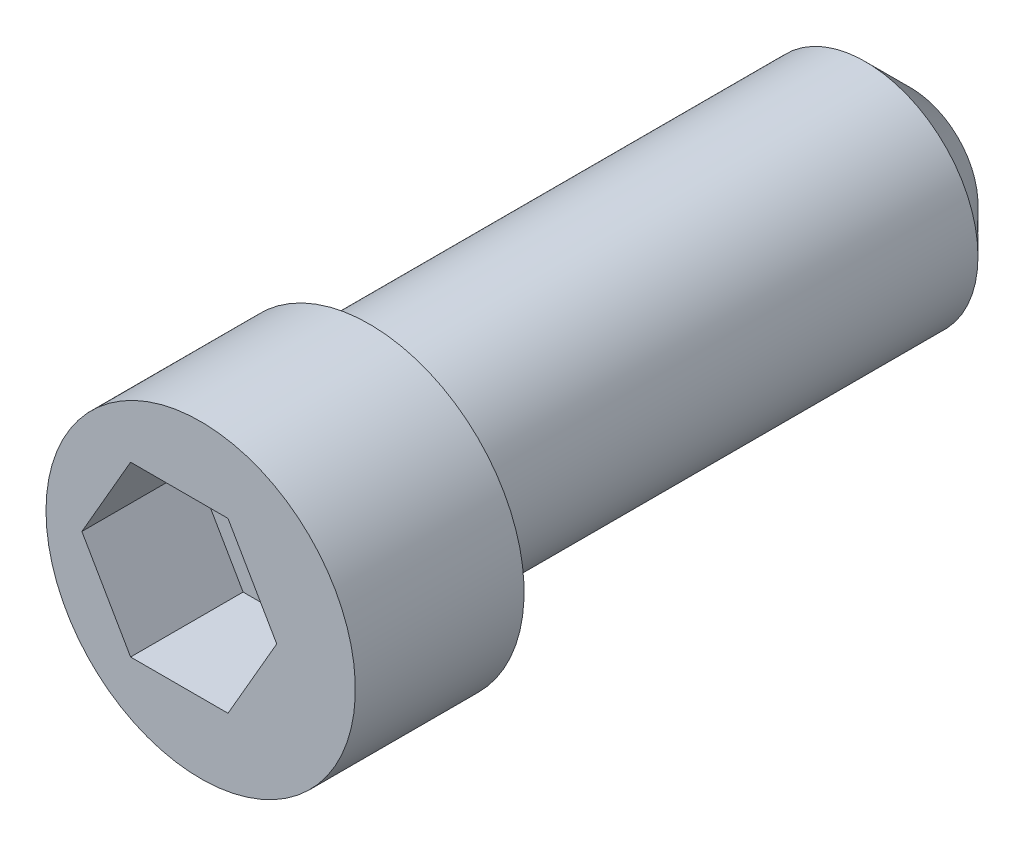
ISO-10303-21;
HEADER;
FILE_DESCRIPTION(('STEP AP214'),'2;1');
FILE_NAME('part.step','',(''),(''),'','','');
FILE_SCHEMA(('AUTOMOTIVE_DESIGN { 1 0 10303 214 1 1 1 1 }'));
ENDSEC;
DATA;
#1=APPLICATION_CONTEXT('core data for automotive mechanical design processes');
#2=APPLICATION_PROTOCOL_DEFINITION('international standard','automotive_design',2000,#1);
#3=PRODUCT_CONTEXT('',#1,'mechanical');
#4=PRODUCT('Part','Part','',(#3));
#5=PRODUCT_RELATED_PRODUCT_CATEGORY('part','',(#4));
#6=PRODUCT_DEFINITION_FORMATION('','',#4);
#7=PRODUCT_DEFINITION_CONTEXT('part definition',#1,'design');
#8=PRODUCT_DEFINITION('design','',#6,#7);
#9=PRODUCT_DEFINITION_SHAPE('','',#8);
#10=(LENGTH_UNIT() NAMED_UNIT(*) SI_UNIT(.MILLI.,.METRE.));
#11=(NAMED_UNIT(*) PLANE_ANGLE_UNIT() SI_UNIT($,.RADIAN.));
#12=(NAMED_UNIT(*) SI_UNIT($,.STERADIAN.) SOLID_ANGLE_UNIT());
#13=UNCERTAINTY_MEASURE_WITH_UNIT(LENGTH_MEASURE(1.E-05),#10,'distance_accuracy_value','');
#14=(GEOMETRIC_REPRESENTATION_CONTEXT(3) GLOBAL_UNCERTAINTY_ASSIGNED_CONTEXT((#13)) GLOBAL_UNIT_ASSIGNED_CONTEXT((#10,
#11,#12)) REPRESENTATION_CONTEXT('',''));
#15=CARTESIAN_POINT('',(0.,0.,0.));
#16=DIRECTION('',(0.,0.,1.));
#17=DIRECTION('',(1.,0.,0.));
#18=AXIS2_PLACEMENT_3D('',#15,#16,#17);
#19=CARTESIAN_POINT('',(-0.00100000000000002,-2.0828,0.));
#20=DIRECTION('',(0.,0.,1.));
#21=DIRECTION('',(-1.,0.,0.));
#22=AXIS2_PLACEMENT_3D('',#19,#20,#21);
#23=PLANE('',#22);
#24=CARTESIAN_POINT('',(0.38,0.,0.));
#25=DIRECTION('',(0.,0.,-1.));
#26=DIRECTION('',(-1.,0.,0.));
#27=AXIS2_PLACEMENT_3D('',#24,#25,#26);
#28=CIRCLE('',#27,2.75);
#29=CARTESIAN_POINT('',(-2.37,0.,0.));
#30=VERTEX_POINT('',#29);
#31=EDGE_CURVE('E120',#30,#30,#28,.T.);
#32=ORIENTED_EDGE('',*,*,#31,.T.);
#33=EDGE_LOOP('',(#32));
#34=FACE_BOUND('',#33,.T.);
#35=CARTESIAN_POINT('',(0.,0.,0.));
#36=DIRECTION('',(0.,0.,1.));
#37=DIRECTION('',(1.,0.,0.));
#38=AXIS2_PLACEMENT_3D('',#35,#36,#37);
#39=CIRCLE('',#38,2.);
#40=CARTESIAN_POINT('',(2.,0.,0.));
#41=VERTEX_POINT('',#40);
#42=EDGE_CURVE('E123',#41,#41,#39,.F.);
#43=ORIENTED_EDGE('',*,*,#42,.F.);
#44=EDGE_LOOP('',(#43));
#45=FACE_BOUND('',#44,.T.);
#46=ADVANCED_FACE('F14',(#34,#45),#23,.F.);
#47=CARTESIAN_POINT('',(0.38,0.,10.));
#48=DIRECTION('',(0.,0.,-1.));
#49=DIRECTION('',(-1.,0.,0.));
#50=AXIS2_PLACEMENT_3D('',#47,#48,#49);
#51=CYLINDRICAL_SURFACE('',#50,2.75);
#52=ORIENTED_EDGE('',*,*,#31,.F.);
#53=EDGE_LOOP('',(#52));
#54=FACE_BOUND('',#53,.T.);
#55=CARTESIAN_POINT('',(0.38,0.,3.));
#56=DIRECTION('',(0.,0.,-1.));
#57=DIRECTION('',(-1.,0.,0.));
#58=AXIS2_PLACEMENT_3D('',#55,#56,#57);
#59=CIRCLE('',#58,2.75);
#60=CARTESIAN_POINT('',(-2.37,0.,3.));
#61=VERTEX_POINT('',#60);
#62=EDGE_CURVE('E71',#61,#61,#59,.T.);
#63=ORIENTED_EDGE('',*,*,#62,.T.);
#64=EDGE_LOOP('',(#63));
#65=FACE_BOUND('',#64,.T.);
#66=ADVANCED_FACE('F143',(#54,#65),#51,.T.);
#67=CARTESIAN_POINT('',(0.38,0.,3.));
#68=DIRECTION('',(0.,0.,-1.));
#69=DIRECTION('',(-1.,0.,0.));
#70=AXIS2_PLACEMENT_3D('',#67,#68,#69);
#71=PLANE('',#70);
#72=DIRECTION('',(-0.5,0.866025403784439,0.));
#73=VECTOR('',#72,1.);
#74=CARTESIAN_POINT('',(1.73205080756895,0.,3.));
#75=LINE('',#74,#73);
#76=CARTESIAN_POINT('',(1.73205080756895,0.,3.));
#77=VERTEX_POINT('',#76);
#78=CARTESIAN_POINT('',(0.866025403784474,1.50000000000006,3.));
#79=VERTEX_POINT('',#78);
#80=EDGE_CURVE('E97',#77,#79,#75,.T.);
#81=ORIENTED_EDGE('',*,*,#80,.F.);
#82=DIRECTION('',(0.5,0.866025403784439,0.));
#83=VECTOR('',#82,1.);
#84=CARTESIAN_POINT('',(0.866025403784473,-1.50000000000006,3.));
#85=LINE('',#84,#83);
#86=CARTESIAN_POINT('',(0.866025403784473,-1.50000000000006,3.));
#87=VERTEX_POINT('',#86);
#88=EDGE_CURVE('E29',#87,#77,#85,.T.);
#89=ORIENTED_EDGE('',*,*,#88,.F.);
#90=DIRECTION('',(1.,0.,0.));
#91=VECTOR('',#90,1.);
#92=CARTESIAN_POINT('',(-0.866025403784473,-1.50000000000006,3.));
#93=LINE('',#92,#91);
#94=CARTESIAN_POINT('',(-0.866025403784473,-1.50000000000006,3.));
#95=VERTEX_POINT('',#94);
#96=EDGE_CURVE('E70',#95,#87,#93,.T.);
#97=ORIENTED_EDGE('',*,*,#96,.F.);
#98=DIRECTION('',(0.5,-0.866025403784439,0.));
#99=VECTOR('',#98,1.);
#100=CARTESIAN_POINT('',(-1.73205080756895,0.,3.));
#101=LINE('',#100,#99);
#102=CARTESIAN_POINT('',(-1.73205080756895,0.,3.));
#103=VERTEX_POINT('',#102);
#104=EDGE_CURVE('E106',#103,#95,#101,.T.);
#105=ORIENTED_EDGE('',*,*,#104,.F.);
#106=DIRECTION('',(-0.5,-0.866025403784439,0.));
#107=VECTOR('',#106,1.);
#108=CARTESIAN_POINT('',(-0.866025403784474,1.50000000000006,3.));
#109=LINE('',#108,#107);
#110=CARTESIAN_POINT('',(-0.866025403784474,1.50000000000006,3.));
#111=VERTEX_POINT('',#110);
#112=EDGE_CURVE('E103',#111,#103,#109,.T.);
#113=ORIENTED_EDGE('',*,*,#112,.F.);
#114=DIRECTION('',(-1.,0.,0.));
#115=VECTOR('',#114,1.);
#116=CARTESIAN_POINT('',(0.866025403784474,1.50000000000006,3.));
#117=LINE('',#116,#115);
#118=EDGE_CURVE('E100',#79,#111,#117,.T.);
#119=ORIENTED_EDGE('',*,*,#118,.F.);
#120=EDGE_LOOP('',(#81,#89,#97,#105,#113,#119));
#121=FACE_BOUND('',#120,.T.);
#122=ORIENTED_EDGE('',*,*,#62,.F.);
#123=EDGE_LOOP('',(#122));
#124=FACE_BOUND('',#123,.T.);
#125=ADVANCED_FACE('F149',(#121,#124),#71,.F.);
#126=CARTESIAN_POINT('',(0.866025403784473,-1.50000000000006,1.5));
#127=DIRECTION('',(0.866025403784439,-0.5,0.));
#128=DIRECTION('',(0.5,0.866025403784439,0.));
#129=AXIS2_PLACEMENT_3D('',#126,#127,#128);
#130=PLANE('',#129);
#131=ORIENTED_EDGE('',*,*,#88,.T.);
#132=DIRECTION('',(0.,0.,1.));
#133=VECTOR('',#132,1.);
#134=CARTESIAN_POINT('',(1.73205080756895,0.,1.5));
#135=LINE('',#134,#133);
#136=CARTESIAN_POINT('',(1.73205080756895,0.,1.));
#137=VERTEX_POINT('',#136);
#138=EDGE_CURVE('E77',#137,#77,#135,.T.);
#139=ORIENTED_EDGE('',*,*,#138,.F.);
#140=DIRECTION('',(0.5,0.866025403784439,0.));
#141=VECTOR('',#140,1.);
#142=CARTESIAN_POINT('',(0.866025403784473,-1.50000000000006,1.));
#143=LINE('',#142,#141);
#144=CARTESIAN_POINT('',(0.866025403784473,-1.50000000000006,1.));
#145=VERTEX_POINT('',#144);
#146=EDGE_CURVE('E75',#145,#137,#143,.T.);
#147=ORIENTED_EDGE('',*,*,#146,.F.);
#148=DIRECTION('',(0.,0.,1.));
#149=VECTOR('',#148,1.);
#150=CARTESIAN_POINT('',(0.866025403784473,-1.50000000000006,1.5));
#151=LINE('',#150,#149);
#152=EDGE_CURVE('E34',#145,#87,#151,.T.);
#153=ORIENTED_EDGE('',*,*,#152,.T.);
#154=EDGE_LOOP('',(#131,#139,#147,#153));
#155=FACE_BOUND('',#154,.T.);
#156=ADVANCED_FACE('F76',(#155),#130,.F.);
#157=CARTESIAN_POINT('',(-0.866025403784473,-1.50000000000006,1.5));
#158=DIRECTION('',(0.,-1.,0.));
#159=DIRECTION('',(0.,0.,-1.));
#160=AXIS2_PLACEMENT_3D('',#157,#158,#159);
#161=PLANE('',#160);
#162=ORIENTED_EDGE('',*,*,#96,.T.);
#163=ORIENTED_EDGE('',*,*,#152,.F.);
#164=DIRECTION('',(1.,0.,0.));
#165=VECTOR('',#164,1.);
#166=CARTESIAN_POINT('',(-0.866025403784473,-1.50000000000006,1.));
#167=LINE('',#166,#165);
#168=CARTESIAN_POINT('',(-0.866025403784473,-1.50000000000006,1.));
#169=VERTEX_POINT('',#168);
#170=EDGE_CURVE('E67',#169,#145,#167,.T.);
#171=ORIENTED_EDGE('',*,*,#170,.F.);
#172=DIRECTION('',(0.,0.,1.));
#173=VECTOR('',#172,1.);
#174=CARTESIAN_POINT('',(-0.866025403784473,-1.50000000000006,1.5));
#175=LINE('',#174,#173);
#176=EDGE_CURVE('E72',#169,#95,#175,.T.);
#177=ORIENTED_EDGE('',*,*,#176,.T.);
#178=EDGE_LOOP('',(#162,#163,#171,#177));
#179=FACE_BOUND('',#178,.T.);
#180=ADVANCED_FACE('F65',(#179),#161,.F.);
#181=CARTESIAN_POINT('',(-1.73205080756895,0.,1.5));
#182=DIRECTION('',(-0.866025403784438,-0.5,0.));
#183=DIRECTION('',(0.5,-0.866025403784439,0.));
#184=AXIS2_PLACEMENT_3D('',#181,#182,#183);
#185=PLANE('',#184);
#186=ORIENTED_EDGE('',*,*,#104,.T.);
#187=ORIENTED_EDGE('',*,*,#176,.F.);
#188=DIRECTION('',(0.5,-0.866025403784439,0.));
#189=VECTOR('',#188,1.);
#190=CARTESIAN_POINT('',(-1.73205080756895,0.,1.));
#191=LINE('',#190,#189);
#192=CARTESIAN_POINT('',(-1.73205080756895,0.,1.));
#193=VERTEX_POINT('',#192);
#194=EDGE_CURVE('E86',#193,#169,#191,.T.);
#195=ORIENTED_EDGE('',*,*,#194,.F.);
#196=DIRECTION('',(0.,0.,1.));
#197=VECTOR('',#196,1.);
#198=CARTESIAN_POINT('',(-1.73205080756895,0.,1.5));
#199=LINE('',#198,#197);
#200=EDGE_CURVE('E111',#193,#103,#199,.T.);
#201=ORIENTED_EDGE('',*,*,#200,.T.);
#202=EDGE_LOOP('',(#186,#187,#195,#201));
#203=FACE_BOUND('',#202,.T.);
#204=ADVANCED_FACE('F170',(#203),#185,.F.);
#205=CARTESIAN_POINT('',(-0.866025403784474,1.50000000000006,1.5));
#206=DIRECTION('',(-0.866025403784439,0.5,0.));
#207=DIRECTION('',(-0.5,-0.866025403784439,0.));
#208=AXIS2_PLACEMENT_3D('',#205,#206,#207);
#209=PLANE('',#208);
#210=ORIENTED_EDGE('',*,*,#112,.T.);
#211=ORIENTED_EDGE('',*,*,#200,.F.);
#212=DIRECTION('',(-0.5,-0.866025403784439,0.));
#213=VECTOR('',#212,1.);
#214=CARTESIAN_POINT('',(-0.866025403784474,1.50000000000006,1.));
#215=LINE('',#214,#213);
#216=CARTESIAN_POINT('',(-0.866025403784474,1.50000000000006,1.));
#217=VERTEX_POINT('',#216);
#218=EDGE_CURVE('E93',#217,#193,#215,.T.);
#219=ORIENTED_EDGE('',*,*,#218,.F.);
#220=DIRECTION('',(0.,0.,1.));
#221=VECTOR('',#220,1.);
#222=CARTESIAN_POINT('',(-0.866025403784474,1.50000000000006,1.5));
#223=LINE('',#222,#221);
#224=EDGE_CURVE('E113',#217,#111,#223,.T.);
#225=ORIENTED_EDGE('',*,*,#224,.T.);
#226=EDGE_LOOP('',(#210,#211,#219,#225));
#227=FACE_BOUND('',#226,.T.);
#228=ADVANCED_FACE('F166',(#227),#209,.F.);
#229=CARTESIAN_POINT('',(0.866025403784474,1.50000000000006,1.5));
#230=DIRECTION('',(0.,1.,0.));
#231=DIRECTION('',(-1.,0.,0.));
#232=AXIS2_PLACEMENT_3D('',#229,#230,#231);
#233=PLANE('',#232);
#234=ORIENTED_EDGE('',*,*,#118,.T.);
#235=ORIENTED_EDGE('',*,*,#224,.F.);
#236=DIRECTION('',(-1.,0.,0.));
#237=VECTOR('',#236,1.);
#238=CARTESIAN_POINT('',(0.866025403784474,1.50000000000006,1.));
#239=LINE('',#238,#237);
#240=CARTESIAN_POINT('',(0.866025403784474,1.50000000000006,1.));
#241=VERTEX_POINT('',#240);
#242=EDGE_CURVE('E90',#241,#217,#239,.T.);
#243=ORIENTED_EDGE('',*,*,#242,.F.);
#244=DIRECTION('',(0.,0.,1.));
#245=VECTOR('',#244,1.);
#246=CARTESIAN_POINT('',(0.866025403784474,1.50000000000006,1.5));
#247=LINE('',#246,#245);
#248=EDGE_CURVE('E115',#241,#79,#247,.T.);
#249=ORIENTED_EDGE('',*,*,#248,.T.);
#250=EDGE_LOOP('',(#234,#235,#243,#249));
#251=FACE_BOUND('',#250,.T.);
#252=ADVANCED_FACE('F162',(#251),#233,.F.);
#253=CARTESIAN_POINT('',(1.73205080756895,0.,1.5));
#254=DIRECTION('',(0.866025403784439,0.5,0.));
#255=DIRECTION('',(-0.5,0.866025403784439,0.));
#256=AXIS2_PLACEMENT_3D('',#253,#254,#255);
#257=PLANE('',#256);
#258=ORIENTED_EDGE('',*,*,#80,.T.);
#259=ORIENTED_EDGE('',*,*,#248,.F.);
#260=DIRECTION('',(-0.5,0.866025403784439,0.));
#261=VECTOR('',#260,1.);
#262=CARTESIAN_POINT('',(1.73205080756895,0.,1.));
#263=LINE('',#262,#261);
#264=EDGE_CURVE('E81',#137,#241,#263,.T.);
#265=ORIENTED_EDGE('',*,*,#264,.F.);
#266=ORIENTED_EDGE('',*,*,#138,.T.);
#267=EDGE_LOOP('',(#258,#259,#265,#266));
#268=FACE_BOUND('',#267,.T.);
#269=ADVANCED_FACE('F159',(#268),#257,.F.);
#270=CARTESIAN_POINT('',(0.,0.,-10.));
#271=DIRECTION('',(0.,0.,1.));
#272=DIRECTION('',(1.,0.,0.));
#273=AXIS2_PLACEMENT_3D('',#270,#271,#272);
#274=CYLINDRICAL_SURFACE('',#273,2.);
#275=CARTESIAN_POINT('',(0.,0.,-9.2));
#276=DIRECTION('',(0.,0.,-1.));
#277=DIRECTION('',(-1.,0.,0.));
#278=AXIS2_PLACEMENT_3D('',#275,#276,#277);
#279=CIRCLE('',#278,2.);
#280=CARTESIAN_POINT('',(-2.,0.,-9.2));
#281=VERTEX_POINT('',#280);
#282=EDGE_CURVE('E9',#281,#281,#279,.F.);
#283=ORIENTED_EDGE('',*,*,#282,.T.);
#284=EDGE_LOOP('',(#283));
#285=FACE_BOUND('',#284,.T.);
#286=ORIENTED_EDGE('',*,*,#42,.T.);
#287=EDGE_LOOP('',(#286));
#288=FACE_BOUND('',#287,.T.);
#289=ADVANCED_FACE('F139',(#285,#288),#274,.T.);
#290=CARTESIAN_POINT('',(0.,0.,-10.));
#291=DIRECTION('',(0.,0.,-1.));
#292=DIRECTION('',(-1.,0.,0.));
#293=AXIS2_PLACEMENT_3D('',#290,#291,#292);
#294=PLANE('',#293);
#295=CARTESIAN_POINT('',(0.,0.,-10.));
#296=DIRECTION('',(0.,0.,-1.));
#297=DIRECTION('',(-1.,0.,0.));
#298=AXIS2_PLACEMENT_3D('',#295,#296,#297);
#299=CIRCLE('',#298,1.2);
#300=CARTESIAN_POINT('',(-1.2,0.,-10.));
#301=VERTEX_POINT('',#300);
#302=EDGE_CURVE('E22',#301,#301,#299,.T.);
#303=ORIENTED_EDGE('',*,*,#302,.T.);
#304=EDGE_LOOP('',(#303));
#305=FACE_BOUND('',#304,.T.);
#306=ADVANCED_FACE('F128',(#305),#294,.T.);
#307=CARTESIAN_POINT('',(0.,0.,-10.));
#308=DIRECTION('',(0.,0.,1.));
#309=DIRECTION('',(1.,0.,0.));
#310=AXIS2_PLACEMENT_3D('',#307,#308,#309);
#311=CONICAL_SURFACE('',#310,1.2,0.785398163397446);
#312=ORIENTED_EDGE('',*,*,#282,.F.);
#313=EDGE_LOOP('',(#312));
#314=FACE_BOUND('',#313,.T.);
#315=ORIENTED_EDGE('',*,*,#302,.F.);
#316=EDGE_LOOP('',(#315));
#317=FACE_BOUND('',#316,.T.);
#318=ADVANCED_FACE('F16',(#314,#317),#311,.T.);
#319=CARTESIAN_POINT('',(0.,0.,1.));
#320=DIRECTION('',(0.,0.,1.));
#321=DIRECTION('',(1.,0.,0.));
#322=AXIS2_PLACEMENT_3D('',#319,#320,#321);
#323=PLANE('',#322);
#324=ORIENTED_EDGE('',*,*,#170,.T.);
#325=ORIENTED_EDGE('',*,*,#146,.T.);
#326=ORIENTED_EDGE('',*,*,#264,.T.);
#327=ORIENTED_EDGE('',*,*,#242,.T.);
#328=ORIENTED_EDGE('',*,*,#218,.T.);
#329=ORIENTED_EDGE('',*,*,#194,.T.);
#330=EDGE_LOOP('',(#324,#325,#326,#327,#328,#329));
#331=FACE_BOUND('',#330,.T.);
#332=ADVANCED_FACE('F83',(#331),#323,.T.);
#333=CLOSED_SHELL('',(#46,#66,#125,#156,#180,#204,#228,#252,#269,#289,#306,#318,#332));
#334=MANIFOLD_SOLID_BREP('B1',#333);
#335=ADVANCED_BREP_SHAPE_REPRESENTATION('',(#18,#334),#14);
#336=SHAPE_DEFINITION_REPRESENTATION(#9,#335);
ENDSEC;
END-ISO-10303-21;
